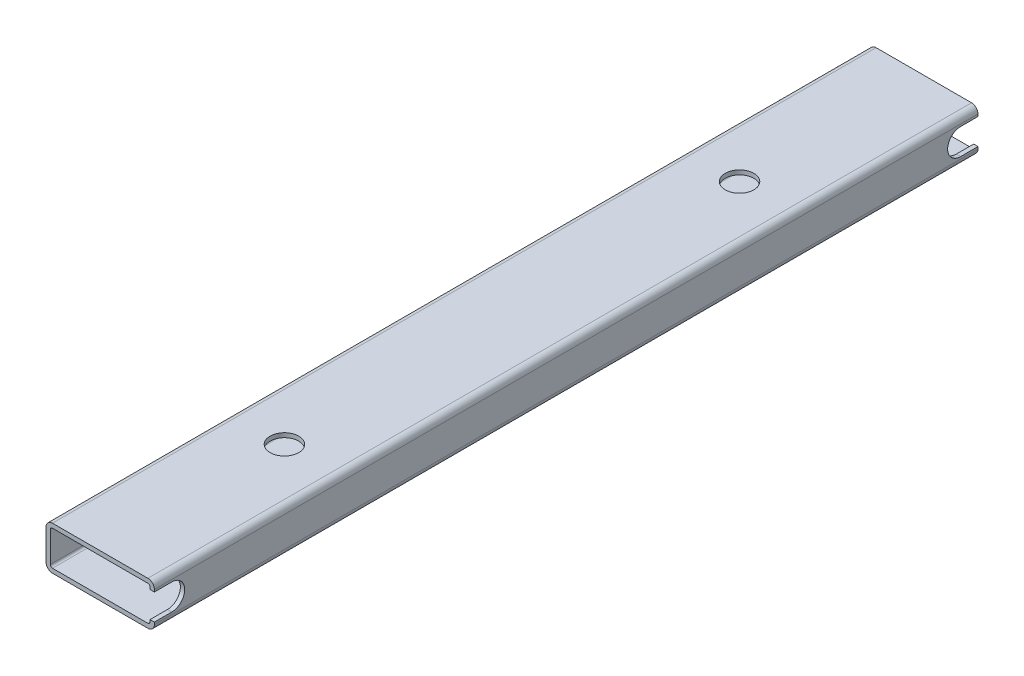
ISO-10303-21;
HEADER;
FILE_DESCRIPTION(('STEP AP214'),'2;1');
FILE_NAME('part.step','',(''),(''),'','','');
FILE_SCHEMA(('AUTOMOTIVE_DESIGN { 1 0 10303 214 1 1 1 1 }'));
ENDSEC;
DATA;
#1=APPLICATION_CONTEXT('core data for automotive mechanical design processes');
#2=APPLICATION_PROTOCOL_DEFINITION('international standard','automotive_design',2000,#1);
#3=PRODUCT_CONTEXT('',#1,'mechanical');
#4=PRODUCT('Part','Part','',(#3));
#5=PRODUCT_RELATED_PRODUCT_CATEGORY('part','',(#4));
#6=PRODUCT_DEFINITION_FORMATION('','',#4);
#7=PRODUCT_DEFINITION_CONTEXT('part definition',#1,'design');
#8=PRODUCT_DEFINITION('design','',#6,#7);
#9=PRODUCT_DEFINITION_SHAPE('','',#8);
#10=(LENGTH_UNIT() NAMED_UNIT(*) SI_UNIT(.MILLI.,.METRE.));
#11=(NAMED_UNIT(*) PLANE_ANGLE_UNIT() SI_UNIT($,.RADIAN.));
#12=(NAMED_UNIT(*) SI_UNIT($,.STERADIAN.) SOLID_ANGLE_UNIT());
#13=UNCERTAINTY_MEASURE_WITH_UNIT(LENGTH_MEASURE(1.E-05),#10,'distance_accuracy_value','');
#14=(GEOMETRIC_REPRESENTATION_CONTEXT(3) GLOBAL_UNCERTAINTY_ASSIGNED_CONTEXT((#13)) GLOBAL_UNIT_ASSIGNED_CONTEXT((#10,
#11,#12)) REPRESENTATION_CONTEXT('',''));
#15=CARTESIAN_POINT('',(0.,0.,0.));
#16=DIRECTION('',(0.,0.,1.));
#17=DIRECTION('',(1.,0.,0.));
#18=AXIS2_PLACEMENT_3D('',#15,#16,#17);
#19=CARTESIAN_POINT('',(-11.,-3.5,-95.));
#20=DIRECTION('',(0.,0.,1.));
#21=DIRECTION('',(1.,0.,0.));
#22=AXIS2_PLACEMENT_3D('',#19,#20,#21);
#23=PLANE('',#22);
#24=DIRECTION('',(1.,0.,0.));
#25=VECTOR('',#24,1.);
#26=CARTESIAN_POINT('',(-12.501,2.99999999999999,-95.));
#27=LINE('',#26,#25);
#28=CARTESIAN_POINT('',(11.5,3.00000000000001,-95.));
#29=VERTEX_POINT('',#28);
#30=CARTESIAN_POINT('',(12.5,3.00000000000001,-95.));
#31=VERTEX_POINT('',#30);
#32=EDGE_CURVE('E222',#29,#31,#27,.T.);
#33=ORIENTED_EDGE('',*,*,#32,.F.);
#34=DIRECTION('',(0.,1.,0.));
#35=VECTOR('',#34,1.);
#36=CARTESIAN_POINT('',(11.5,3.5,-95.));
#37=LINE('',#36,#35);
#38=CARTESIAN_POINT('',(11.5,3.5,-95.));
#39=VERTEX_POINT('',#38);
#40=EDGE_CURVE('E304',#29,#39,#37,.T.);
#41=ORIENTED_EDGE('',*,*,#40,.T.);
#42=CARTESIAN_POINT('',(11.,3.5,-95.));
#43=DIRECTION('',(0.,0.,1.));
#44=DIRECTION('',(-1.,0.,0.));
#45=AXIS2_PLACEMENT_3D('',#42,#43,#44);
#46=CIRCLE('',#45,0.5);
#47=CARTESIAN_POINT('',(11.,4.,-95.));
#48=VERTEX_POINT('',#47);
#49=EDGE_CURVE('E307',#39,#48,#46,.T.);
#50=ORIENTED_EDGE('',*,*,#49,.T.);
#51=DIRECTION('',(-1.,0.,0.));
#52=VECTOR('',#51,1.);
#53=CARTESIAN_POINT('',(-11.,4.,-95.));
#54=LINE('',#53,#52);
#55=CARTESIAN_POINT('',(-11.,4.,-95.));
#56=VERTEX_POINT('',#55);
#57=EDGE_CURVE('E272',#48,#56,#54,.T.);
#58=ORIENTED_EDGE('',*,*,#57,.T.);
#59=CARTESIAN_POINT('',(-11.,3.5,-95.));
#60=DIRECTION('',(0.,0.,1.));
#61=DIRECTION('',(1.,0.,0.));
#62=AXIS2_PLACEMENT_3D('',#59,#60,#61);
#63=CIRCLE('',#62,0.499999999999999);
#64=CARTESIAN_POINT('',(-11.5,3.5,-95.));
#65=VERTEX_POINT('',#64);
#66=EDGE_CURVE('E268',#56,#65,#63,.T.);
#67=ORIENTED_EDGE('',*,*,#66,.T.);
#68=DIRECTION('',(0.,-1.,0.));
#69=VECTOR('',#68,1.);
#70=CARTESIAN_POINT('',(-11.5,3.5,-95.));
#71=LINE('',#70,#69);
#72=CARTESIAN_POINT('',(-11.5,-3.5,-95.));
#73=VERTEX_POINT('',#72);
#74=EDGE_CURVE('E292',#65,#73,#71,.T.);
#75=ORIENTED_EDGE('',*,*,#74,.T.);
#76=CARTESIAN_POINT('',(-11.,-3.5,-95.));
#77=DIRECTION('',(0.,0.,1.));
#78=DIRECTION('',(1.,0.,0.));
#79=AXIS2_PLACEMENT_3D('',#76,#77,#78);
#80=CIRCLE('',#79,0.5);
#81=CARTESIAN_POINT('',(-11.,-4.,-95.));
#82=VERTEX_POINT('',#81);
#83=EDGE_CURVE('E295',#73,#82,#80,.T.);
#84=ORIENTED_EDGE('',*,*,#83,.T.);
#85=DIRECTION('',(1.,0.,0.));
#86=VECTOR('',#85,1.);
#87=CARTESIAN_POINT('',(-11.,-4.,-95.));
#88=LINE('',#87,#86);
#89=CARTESIAN_POINT('',(11.,-4.,-95.));
#90=VERTEX_POINT('',#89);
#91=EDGE_CURVE('E298',#82,#90,#88,.T.);
#92=ORIENTED_EDGE('',*,*,#91,.T.);
#93=CARTESIAN_POINT('',(11.,-3.5,-95.));
#94=DIRECTION('',(0.,0.,1.));
#95=DIRECTION('',(1.,0.,0.));
#96=AXIS2_PLACEMENT_3D('',#93,#94,#95);
#97=CIRCLE('',#96,0.499999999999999);
#98=CARTESIAN_POINT('',(11.5,-3.5,-95.));
#99=VERTEX_POINT('',#98);
#100=EDGE_CURVE('E301',#90,#99,#97,.T.);
#101=ORIENTED_EDGE('',*,*,#100,.T.);
#102=CARTESIAN_POINT('',(11.5,-3.,-95.));
#103=VERTEX_POINT('',#102);
#104=EDGE_CURVE('E305',#99,#103,#37,.T.);
#105=ORIENTED_EDGE('',*,*,#104,.T.);
#106=DIRECTION('',(1.,0.,0.));
#107=VECTOR('',#106,1.);
#108=CARTESIAN_POINT('',(-12.501,-3.00000000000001,-95.));
#109=LINE('',#108,#107);
#110=CARTESIAN_POINT('',(12.5,-2.99999999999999,-95.));
#111=VERTEX_POINT('',#110);
#112=EDGE_CURVE('E48',#103,#111,#109,.T.);
#113=ORIENTED_EDGE('',*,*,#112,.T.);
#114=DIRECTION('',(0.,1.,0.));
#115=VECTOR('',#114,1.);
#116=CARTESIAN_POINT('',(12.5,3.5,-95.));
#117=LINE('',#116,#115);
#118=CARTESIAN_POINT('',(12.5,-3.5,-95.));
#119=VERTEX_POINT('',#118);
#120=EDGE_CURVE('E359',#119,#111,#117,.T.);
#121=ORIENTED_EDGE('',*,*,#120,.F.);
#122=CARTESIAN_POINT('',(11.,-3.5,-95.));
#123=DIRECTION('',(0.,0.,1.));
#124=DIRECTION('',(1.,0.,0.));
#125=AXIS2_PLACEMENT_3D('',#122,#123,#124);
#126=CIRCLE('',#125,1.5);
#127=CARTESIAN_POINT('',(11.,-5.,-95.));
#128=VERTEX_POINT('',#127);
#129=EDGE_CURVE('E356',#128,#119,#126,.T.);
#130=ORIENTED_EDGE('',*,*,#129,.F.);
#131=DIRECTION('',(1.,0.,0.));
#132=VECTOR('',#131,1.);
#133=CARTESIAN_POINT('',(-11.,-5.,-95.));
#134=LINE('',#133,#132);
#135=CARTESIAN_POINT('',(-11.,-5.,-95.));
#136=VERTEX_POINT('',#135);
#137=EDGE_CURVE('E354',#136,#128,#134,.T.);
#138=ORIENTED_EDGE('',*,*,#137,.F.);
#139=CARTESIAN_POINT('',(-11.,-3.5,-95.));
#140=DIRECTION('',(0.,0.,1.));
#141=DIRECTION('',(1.,0.,0.));
#142=AXIS2_PLACEMENT_3D('',#139,#140,#141);
#143=CIRCLE('',#142,1.5);
#144=CARTESIAN_POINT('',(-12.5,-3.5,-95.));
#145=VERTEX_POINT('',#144);
#146=EDGE_CURVE('E330',#145,#136,#143,.T.);
#147=ORIENTED_EDGE('',*,*,#146,.F.);
#148=DIRECTION('',(0.,-1.,0.));
#149=VECTOR('',#148,1.);
#150=CARTESIAN_POINT('',(-12.5,3.5,-95.));
#151=LINE('',#150,#149);
#152=CARTESIAN_POINT('',(-12.5,3.5,-95.));
#153=VERTEX_POINT('',#152);
#154=EDGE_CURVE('E335',#153,#145,#151,.T.);
#155=ORIENTED_EDGE('',*,*,#154,.F.);
#156=CARTESIAN_POINT('',(-11.,3.5,-95.));
#157=DIRECTION('',(0.,0.,1.));
#158=DIRECTION('',(1.,0.,0.));
#159=AXIS2_PLACEMENT_3D('',#156,#157,#158);
#160=CIRCLE('',#159,1.5);
#161=CARTESIAN_POINT('',(-11.,5.,-95.));
#162=VERTEX_POINT('',#161);
#163=EDGE_CURVE('E366',#162,#153,#160,.T.);
#164=ORIENTED_EDGE('',*,*,#163,.F.);
#165=DIRECTION('',(-1.,0.,0.));
#166=VECTOR('',#165,1.);
#167=CARTESIAN_POINT('',(-11.,5.,-95.));
#168=LINE('',#167,#166);
#169=CARTESIAN_POINT('',(11.,5.,-95.));
#170=VERTEX_POINT('',#169);
#171=EDGE_CURVE('E364',#170,#162,#168,.T.);
#172=ORIENTED_EDGE('',*,*,#171,.F.);
#173=CARTESIAN_POINT('',(11.,3.5,-95.));
#174=DIRECTION('',(0.,0.,1.));
#175=DIRECTION('',(-1.,0.,0.));
#176=AXIS2_PLACEMENT_3D('',#173,#174,#175);
#177=CIRCLE('',#176,1.5);
#178=CARTESIAN_POINT('',(12.5,3.5,-95.));
#179=VERTEX_POINT('',#178);
#180=EDGE_CURVE('E362',#179,#170,#177,.T.);
#181=ORIENTED_EDGE('',*,*,#180,.F.);
#182=EDGE_CURVE('E358',#31,#179,#117,.T.);
#183=ORIENTED_EDGE('',*,*,#182,.F.);
#184=EDGE_LOOP('',(#33,#41,#50,#58,#67,#75,#84,#92,#101,#105,#113,#121,#130,#138,#147,#155,#164,
#172,#181,#183));
#185=FACE_BOUND('',#184,.T.);
#186=ADVANCED_FACE('F32',(#185),#23,.F.);
#187=CARTESIAN_POINT('',(12.5,3.5,95.));
#188=DIRECTION('',(-1.,0.,0.));
#189=DIRECTION('',(0.,-1.,0.));
#190=AXIS2_PLACEMENT_3D('',#187,#188,#189);
#191=PLANE('',#190);
#192=DIRECTION('',(0.,0.,-1.));
#193=VECTOR('',#192,1.);
#194=CARTESIAN_POINT('',(12.5,3.00000000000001,-95.));
#195=LINE('',#194,#193);
#196=CARTESIAN_POINT('',(12.5,3.00000000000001,-91.));
#197=VERTEX_POINT('',#196);
#198=EDGE_CURVE('E203',#197,#31,#195,.T.);
#199=ORIENTED_EDGE('',*,*,#198,.T.);
#200=ORIENTED_EDGE('',*,*,#182,.T.);
#201=DIRECTION('',(0.,0.,-1.));
#202=VECTOR('',#201,1.);
#203=CARTESIAN_POINT('',(12.5,3.5,95.));
#204=LINE('',#203,#202);
#205=CARTESIAN_POINT('',(12.5,3.5,95.));
#206=VERTEX_POINT('',#205);
#207=EDGE_CURVE('E380',#206,#179,#204,.T.);
#208=ORIENTED_EDGE('',*,*,#207,.F.);
#209=DIRECTION('',(0.,1.,0.));
#210=VECTOR('',#209,1.);
#211=CARTESIAN_POINT('',(12.5,3.5,95.));
#212=LINE('',#211,#210);
#213=CARTESIAN_POINT('',(12.5,3.00000000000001,95.));
#214=VERTEX_POINT('',#213);
#215=EDGE_CURVE('E339',#214,#206,#212,.T.);
#216=ORIENTED_EDGE('',*,*,#215,.F.);
#217=DIRECTION('',(0.,0.,1.));
#218=VECTOR('',#217,1.);
#219=CARTESIAN_POINT('',(12.5,3.00000000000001,95.));
#220=LINE('',#219,#218);
#221=CARTESIAN_POINT('',(12.5,3.00000000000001,91.));
#222=VERTEX_POINT('',#221);
#223=EDGE_CURVE('E235',#222,#214,#220,.T.);
#224=ORIENTED_EDGE('',*,*,#223,.F.);
#225=CARTESIAN_POINT('',(12.5,0.,91.));
#226=DIRECTION('',(1.,0.,0.));
#227=DIRECTION('',(0.,-1.,0.));
#228=AXIS2_PLACEMENT_3D('',#225,#226,#227);
#229=CIRCLE('',#228,3.);
#230=CARTESIAN_POINT('',(12.5,-2.99999999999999,91.));
#231=VERTEX_POINT('',#230);
#232=EDGE_CURVE('E232',#231,#222,#229,.T.);
#233=ORIENTED_EDGE('',*,*,#232,.F.);
#234=DIRECTION('',(0.,0.,-1.));
#235=VECTOR('',#234,1.);
#236=CARTESIAN_POINT('',(12.5,-2.99999999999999,91.));
#237=LINE('',#236,#235);
#238=CARTESIAN_POINT('',(12.5,-2.99999999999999,95.));
#239=VERTEX_POINT('',#238);
#240=EDGE_CURVE('E229',#239,#231,#237,.T.);
#241=ORIENTED_EDGE('',*,*,#240,.F.);
#242=CARTESIAN_POINT('',(12.5,-3.5,95.));
#243=VERTEX_POINT('',#242);
#244=EDGE_CURVE('E340',#243,#239,#212,.T.);
#245=ORIENTED_EDGE('',*,*,#244,.F.);
#246=DIRECTION('',(0.,0.,-1.));
#247=VECTOR('',#246,1.);
#248=CARTESIAN_POINT('',(12.5,-3.5,95.));
#249=LINE('',#248,#247);
#250=EDGE_CURVE('E383',#243,#119,#249,.T.);
#251=ORIENTED_EDGE('',*,*,#250,.T.);
#252=ORIENTED_EDGE('',*,*,#120,.T.);
#253=DIRECTION('',(0.,0.,1.));
#254=VECTOR('',#253,1.);
#255=CARTESIAN_POINT('',(12.5,-2.99999999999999,-91.));
#256=LINE('',#255,#254);
#257=CARTESIAN_POINT('',(12.5,-2.99999999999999,-91.));
#258=VERTEX_POINT('',#257);
#259=EDGE_CURVE('E219',#111,#258,#256,.T.);
#260=ORIENTED_EDGE('',*,*,#259,.T.);
#261=CARTESIAN_POINT('',(12.5,0.,-91.));
#262=DIRECTION('',(-1.,0.,0.));
#263=DIRECTION('',(0.,-1.,0.));
#264=AXIS2_PLACEMENT_3D('',#261,#262,#263);
#265=CIRCLE('',#264,3.);
#266=EDGE_CURVE('E201',#258,#197,#265,.T.);
#267=ORIENTED_EDGE('',*,*,#266,.T.);
#268=EDGE_LOOP('',(#199,#200,#208,#216,#224,#233,#241,#245,#251,#252,#260,#267));
#269=FACE_BOUND('',#268,.T.);
#270=ADVANCED_FACE('F400',(#269),#191,.F.);
#271=CARTESIAN_POINT('',(11.5,3.5,95.));
#272=DIRECTION('',(-1.,0.,0.));
#273=DIRECTION('',(0.,0.,1.));
#274=AXIS2_PLACEMENT_3D('',#271,#272,#273);
#275=PLANE('',#274);
#276=ORIENTED_EDGE('',*,*,#40,.F.);
#277=DIRECTION('',(0.,0.,-1.));
#278=VECTOR('',#277,1.);
#279=CARTESIAN_POINT('',(11.5,3.00000000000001,-95.));
#280=LINE('',#279,#278);
#281=CARTESIAN_POINT('',(11.5,3.00000000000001,-91.));
#282=VERTEX_POINT('',#281);
#283=EDGE_CURVE('E213',#282,#29,#280,.T.);
#284=ORIENTED_EDGE('',*,*,#283,.F.);
#285=CARTESIAN_POINT('',(11.5,0.,-91.));
#286=DIRECTION('',(-1.,0.,0.));
#287=DIRECTION('',(0.,0.,1.));
#288=AXIS2_PLACEMENT_3D('',#285,#286,#287);
#289=CIRCLE('',#288,3.);
#290=CARTESIAN_POINT('',(11.5,-2.99999999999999,-91.));
#291=VERTEX_POINT('',#290);
#292=EDGE_CURVE('E198',#291,#282,#289,.T.);
#293=ORIENTED_EDGE('',*,*,#292,.F.);
#294=DIRECTION('',(0.,0.,1.));
#295=VECTOR('',#294,1.);
#296=CARTESIAN_POINT('',(11.5,-2.99999999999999,-91.));
#297=LINE('',#296,#295);
#298=EDGE_CURVE('E205',#103,#291,#297,.T.);
#299=ORIENTED_EDGE('',*,*,#298,.F.);
#300=ORIENTED_EDGE('',*,*,#104,.F.);
#301=DIRECTION('',(0.,0.,-1.));
#302=VECTOR('',#301,1.);
#303=CARTESIAN_POINT('',(11.5,-3.5,95.));
#304=LINE('',#303,#302);
#305=CARTESIAN_POINT('',(11.5,-3.5,95.));
#306=VERTEX_POINT('',#305);
#307=EDGE_CURVE('E319',#306,#99,#304,.T.);
#308=ORIENTED_EDGE('',*,*,#307,.F.);
#309=DIRECTION('',(0.,1.,0.));
#310=VECTOR('',#309,1.);
#311=CARTESIAN_POINT('',(11.5,3.5,95.));
#312=LINE('',#311,#310);
#313=CARTESIAN_POINT('',(11.5,-3.,95.));
#314=VERTEX_POINT('',#313);
#315=EDGE_CURVE('E281',#306,#314,#312,.T.);
#316=ORIENTED_EDGE('',*,*,#315,.T.);
#317=DIRECTION('',(0.,0.,-1.));
#318=VECTOR('',#317,1.);
#319=CARTESIAN_POINT('',(11.5,-2.99999999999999,91.));
#320=LINE('',#319,#318);
#321=CARTESIAN_POINT('',(11.5,-2.99999999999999,91.));
#322=VERTEX_POINT('',#321);
#323=EDGE_CURVE('E239',#314,#322,#320,.T.);
#324=ORIENTED_EDGE('',*,*,#323,.T.);
#325=CARTESIAN_POINT('',(11.5,0.,91.));
#326=DIRECTION('',(-1.,0.,0.));
#327=DIRECTION('',(0.,0.,1.));
#328=AXIS2_PLACEMENT_3D('',#325,#326,#327);
#329=CIRCLE('',#328,3.);
#330=CARTESIAN_POINT('',(11.5,3.00000000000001,91.));
#331=VERTEX_POINT('',#330);
#332=EDGE_CURVE('E224',#322,#331,#329,.F.);
#333=ORIENTED_EDGE('',*,*,#332,.T.);
#334=DIRECTION('',(0.,0.,1.));
#335=VECTOR('',#334,1.);
#336=CARTESIAN_POINT('',(11.5,3.00000000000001,95.));
#337=LINE('',#336,#335);
#338=CARTESIAN_POINT('',(11.5,3.00000000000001,95.));
#339=VERTEX_POINT('',#338);
#340=EDGE_CURVE('E227',#331,#339,#337,.T.);
#341=ORIENTED_EDGE('',*,*,#340,.T.);
#342=CARTESIAN_POINT('',(11.5,3.5,95.));
#343=VERTEX_POINT('',#342);
#344=EDGE_CURVE('E280',#339,#343,#312,.T.);
#345=ORIENTED_EDGE('',*,*,#344,.T.);
#346=DIRECTION('',(0.,0.,-1.));
#347=VECTOR('',#346,1.);
#348=CARTESIAN_POINT('',(11.5,3.5,95.));
#349=LINE('',#348,#347);
#350=EDGE_CURVE('E316',#343,#39,#349,.T.);
#351=ORIENTED_EDGE('',*,*,#350,.T.);
#352=EDGE_LOOP('',(#276,#284,#293,#299,#300,#308,#316,#324,#333,#341,#345,#351));
#353=FACE_BOUND('',#352,.T.);
#354=ADVANCED_FACE('F212',(#353),#275,.T.);
#355=CARTESIAN_POINT('',(-11.,-3.5,95.));
#356=DIRECTION('',(0.,0.,1.));
#357=DIRECTION('',(1.,0.,0.));
#358=AXIS2_PLACEMENT_3D('',#355,#356,#357);
#359=PLANE('',#358);
#360=DIRECTION('',(1.,0.,0.));
#361=VECTOR('',#360,1.);
#362=CARTESIAN_POINT('',(-12.501,-3.00000000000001,95.));
#363=LINE('',#362,#361);
#364=EDGE_CURVE('E237',#314,#239,#363,.T.);
#365=ORIENTED_EDGE('',*,*,#364,.F.);
#366=ORIENTED_EDGE('',*,*,#315,.F.);
#367=CARTESIAN_POINT('',(11.,-3.5,95.));
#368=DIRECTION('',(0.,0.,1.));
#369=DIRECTION('',(1.,0.,0.));
#370=AXIS2_PLACEMENT_3D('',#367,#368,#369);
#371=CIRCLE('',#370,0.499999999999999);
#372=CARTESIAN_POINT('',(11.,-4.,95.));
#373=VERTEX_POINT('',#372);
#374=EDGE_CURVE('E278',#373,#306,#371,.T.);
#375=ORIENTED_EDGE('',*,*,#374,.F.);
#376=DIRECTION('',(1.,0.,0.));
#377=VECTOR('',#376,1.);
#378=CARTESIAN_POINT('',(-11.,-4.,95.));
#379=LINE('',#378,#377);
#380=CARTESIAN_POINT('',(-11.,-4.,95.));
#381=VERTEX_POINT('',#380);
#382=EDGE_CURVE('E276',#381,#373,#379,.T.);
#383=ORIENTED_EDGE('',*,*,#382,.F.);
#384=CARTESIAN_POINT('',(-11.,-3.5,95.));
#385=DIRECTION('',(0.,0.,1.));
#386=DIRECTION('',(1.,0.,0.));
#387=AXIS2_PLACEMENT_3D('',#384,#385,#386);
#388=CIRCLE('',#387,0.5);
#389=CARTESIAN_POINT('',(-11.5,-3.5,95.));
#390=VERTEX_POINT('',#389);
#391=EDGE_CURVE('E274',#390,#381,#388,.T.);
#392=ORIENTED_EDGE('',*,*,#391,.F.);
#393=DIRECTION('',(0.,-1.,0.));
#394=VECTOR('',#393,1.);
#395=CARTESIAN_POINT('',(-11.5,3.5,95.));
#396=LINE('',#395,#394);
#397=CARTESIAN_POINT('',(-11.5,3.5,95.));
#398=VERTEX_POINT('',#397);
#399=EDGE_CURVE('E271',#398,#390,#396,.T.);
#400=ORIENTED_EDGE('',*,*,#399,.F.);
#401=CARTESIAN_POINT('',(-11.,3.5,95.));
#402=DIRECTION('',(0.,0.,1.));
#403=DIRECTION('',(1.,0.,0.));
#404=AXIS2_PLACEMENT_3D('',#401,#402,#403);
#405=CIRCLE('',#404,0.499999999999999);
#406=CARTESIAN_POINT('',(-11.,4.,95.));
#407=VERTEX_POINT('',#406);
#408=EDGE_CURVE('E269',#407,#398,#405,.T.);
#409=ORIENTED_EDGE('',*,*,#408,.F.);
#410=DIRECTION('',(-1.,0.,0.));
#411=VECTOR('',#410,1.);
#412=CARTESIAN_POINT('',(-11.,4.,95.));
#413=LINE('',#412,#411);
#414=CARTESIAN_POINT('',(11.,4.,95.));
#415=VERTEX_POINT('',#414);
#416=EDGE_CURVE('E287',#415,#407,#413,.T.);
#417=ORIENTED_EDGE('',*,*,#416,.F.);
#418=CARTESIAN_POINT('',(11.,3.5,95.));
#419=DIRECTION('',(0.,0.,1.));
#420=DIRECTION('',(-1.,0.,0.));
#421=AXIS2_PLACEMENT_3D('',#418,#419,#420);
#422=CIRCLE('',#421,0.5);
#423=EDGE_CURVE('E284',#343,#415,#422,.T.);
#424=ORIENTED_EDGE('',*,*,#423,.F.);
#425=ORIENTED_EDGE('',*,*,#344,.F.);
#426=DIRECTION('',(1.,0.,0.));
#427=VECTOR('',#426,1.);
#428=CARTESIAN_POINT('',(-12.501,2.99999999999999,95.));
#429=LINE('',#428,#427);
#430=EDGE_CURVE('E56',#339,#214,#429,.T.);
#431=ORIENTED_EDGE('',*,*,#430,.T.);
#432=ORIENTED_EDGE('',*,*,#215,.T.);
#433=CARTESIAN_POINT('',(11.,3.5,95.));
#434=DIRECTION('',(0.,0.,1.));
#435=DIRECTION('',(-1.,0.,0.));
#436=AXIS2_PLACEMENT_3D('',#433,#434,#435);
#437=CIRCLE('',#436,1.5);
#438=CARTESIAN_POINT('',(11.,5.,95.));
#439=VERTEX_POINT('',#438);
#440=EDGE_CURVE('E343',#206,#439,#437,.T.);
#441=ORIENTED_EDGE('',*,*,#440,.T.);
#442=DIRECTION('',(-1.,0.,0.));
#443=VECTOR('',#442,1.);
#444=CARTESIAN_POINT('',(-11.,5.,95.));
#445=LINE('',#444,#443);
#446=CARTESIAN_POINT('',(-11.,5.,95.));
#447=VERTEX_POINT('',#446);
#448=EDGE_CURVE('E345',#439,#447,#445,.T.);
#449=ORIENTED_EDGE('',*,*,#448,.T.);
#450=CARTESIAN_POINT('',(-11.,3.5,95.));
#451=DIRECTION('',(0.,0.,1.));
#452=DIRECTION('',(1.,0.,0.));
#453=AXIS2_PLACEMENT_3D('',#450,#451,#452);
#454=CIRCLE('',#453,1.5);
#455=CARTESIAN_POINT('',(-12.5,3.5,95.));
#456=VERTEX_POINT('',#455);
#457=EDGE_CURVE('E347',#447,#456,#454,.T.);
#458=ORIENTED_EDGE('',*,*,#457,.T.);
#459=DIRECTION('',(0.,-1.,0.));
#460=VECTOR('',#459,1.);
#461=CARTESIAN_POINT('',(-12.5,3.5,95.));
#462=LINE('',#461,#460);
#463=CARTESIAN_POINT('',(-12.5,-3.5,95.));
#464=VERTEX_POINT('',#463);
#465=EDGE_CURVE('E349',#456,#464,#462,.T.);
#466=ORIENTED_EDGE('',*,*,#465,.T.);
#467=CARTESIAN_POINT('',(-11.,-3.5,95.));
#468=DIRECTION('',(0.,0.,1.));
#469=DIRECTION('',(1.,0.,0.));
#470=AXIS2_PLACEMENT_3D('',#467,#468,#469);
#471=CIRCLE('',#470,1.5);
#472=CARTESIAN_POINT('',(-11.,-5.,95.));
#473=VERTEX_POINT('',#472);
#474=EDGE_CURVE('E331',#464,#473,#471,.T.);
#475=ORIENTED_EDGE('',*,*,#474,.T.);
#476=DIRECTION('',(1.,0.,0.));
#477=VECTOR('',#476,1.);
#478=CARTESIAN_POINT('',(-11.,-5.,95.));
#479=LINE('',#478,#477);
#480=CARTESIAN_POINT('',(11.,-5.,95.));
#481=VERTEX_POINT('',#480);
#482=EDGE_CURVE('E334',#473,#481,#479,.T.);
#483=ORIENTED_EDGE('',*,*,#482,.T.);
#484=CARTESIAN_POINT('',(11.,-3.5,95.));
#485=DIRECTION('',(0.,0.,1.));
#486=DIRECTION('',(1.,0.,0.));
#487=AXIS2_PLACEMENT_3D('',#484,#485,#486);
#488=CIRCLE('',#487,1.5);
#489=EDGE_CURVE('E337',#481,#243,#488,.T.);
#490=ORIENTED_EDGE('',*,*,#489,.T.);
#491=ORIENTED_EDGE('',*,*,#244,.T.);
#492=EDGE_LOOP('',(#365,#366,#375,#383,#392,#400,#409,#417,#424,#425,#431,#432,#441,#449,#458,
#466,#475,#483,#490,#491));
#493=FACE_BOUND('',#492,.T.);
#494=ADVANCED_FACE('F406',(#493),#359,.T.);
#495=CARTESIAN_POINT('',(-11.,-3.5,95.));
#496=DIRECTION('',(0.,0.,-1.));
#497=DIRECTION('',(-1.,0.,0.));
#498=AXIS2_PLACEMENT_3D('',#495,#496,#497);
#499=CYLINDRICAL_SURFACE('',#498,1.5);
#500=ORIENTED_EDGE('',*,*,#146,.T.);
#501=DIRECTION('',(0.,0.,-1.));
#502=VECTOR('',#501,1.);
#503=CARTESIAN_POINT('',(-11.,-5.,95.));
#504=LINE('',#503,#502);
#505=EDGE_CURVE('E11',#473,#136,#504,.T.);
#506=ORIENTED_EDGE('',*,*,#505,.F.);
#507=ORIENTED_EDGE('',*,*,#474,.F.);
#508=DIRECTION('',(0.,0.,-1.));
#509=VECTOR('',#508,1.);
#510=CARTESIAN_POINT('',(-12.5,-3.5,95.));
#511=LINE('',#510,#509);
#512=EDGE_CURVE('E351',#464,#145,#511,.T.);
#513=ORIENTED_EDGE('',*,*,#512,.T.);
#514=EDGE_LOOP('',(#500,#506,#507,#513));
#515=FACE_BOUND('',#514,.T.);
#516=ADVANCED_FACE('F34',(#515),#499,.T.);
#517=CARTESIAN_POINT('',(-11.,-5.,95.));
#518=DIRECTION('',(0.,1.,0.));
#519=DIRECTION('',(-1.,0.,0.));
#520=AXIS2_PLACEMENT_3D('',#517,#518,#519);
#521=PLANE('',#520);
#522=CARTESIAN_POINT('',(0.,-4.99999999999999,52.5));
#523=DIRECTION('',(0.,1.,0.));
#524=DIRECTION('',(0.,0.,1.));
#525=AXIS2_PLACEMENT_3D('',#522,#523,#524);
#526=CIRCLE('',#525,3.29999999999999);
#527=CARTESIAN_POINT('',(0.,-4.99999999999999,55.8));
#528=VERTEX_POINT('',#527);
#529=EDGE_CURVE('E250',#528,#528,#526,.T.);
#530=ORIENTED_EDGE('',*,*,#529,.T.);
#531=EDGE_LOOP('',(#530));
#532=FACE_BOUND('',#531,.T.);
#533=CARTESIAN_POINT('',(0.,-4.99999999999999,-52.5));
#534=DIRECTION('',(0.,1.,0.));
#535=DIRECTION('',(0.,0.,1.));
#536=AXIS2_PLACEMENT_3D('',#533,#534,#535);
#537=CIRCLE('',#536,3.29999999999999);
#538=CARTESIAN_POINT('',(0.,-4.99999999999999,-49.2));
#539=VERTEX_POINT('',#538);
#540=EDGE_CURVE('E259',#539,#539,#537,.T.);
#541=ORIENTED_EDGE('',*,*,#540,.T.);
#542=EDGE_LOOP('',(#541));
#543=FACE_BOUND('',#542,.T.);
#544=ORIENTED_EDGE('',*,*,#137,.T.);
#545=DIRECTION('',(0.,0.,-1.));
#546=VECTOR('',#545,1.);
#547=CARTESIAN_POINT('',(11.,-5.,95.));
#548=LINE('',#547,#546);
#549=EDGE_CURVE('E41',#481,#128,#548,.T.);
#550=ORIENTED_EDGE('',*,*,#549,.F.);
#551=ORIENTED_EDGE('',*,*,#482,.F.);
#552=ORIENTED_EDGE('',*,*,#505,.T.);
#553=EDGE_LOOP('',(#544,#550,#551,#552));
#554=FACE_BOUND('',#553,.T.);
#555=ADVANCED_FACE('F410',(#532,#543,#554),#521,.F.);
#556=CARTESIAN_POINT('',(11.,-3.5,95.));
#557=DIRECTION('',(0.,0.,-1.));
#558=DIRECTION('',(-1.,0.,0.));
#559=AXIS2_PLACEMENT_3D('',#556,#557,#558);
#560=CYLINDRICAL_SURFACE('',#559,1.5);
#561=ORIENTED_EDGE('',*,*,#129,.T.);
#562=ORIENTED_EDGE('',*,*,#250,.F.);
#563=ORIENTED_EDGE('',*,*,#489,.F.);
#564=ORIENTED_EDGE('',*,*,#549,.T.);
#565=EDGE_LOOP('',(#561,#562,#563,#564));
#566=FACE_BOUND('',#565,.T.);
#567=ADVANCED_FACE('F391',(#566),#560,.T.);
#568=CARTESIAN_POINT('',(11.,3.5,95.));
#569=DIRECTION('',(0.,0.,-1.));
#570=DIRECTION('',(-1.,0.,0.));
#571=AXIS2_PLACEMENT_3D('',#568,#569,#570);
#572=CYLINDRICAL_SURFACE('',#571,1.5);
#573=ORIENTED_EDGE('',*,*,#180,.T.);
#574=DIRECTION('',(0.,0.,-1.));
#575=VECTOR('',#574,1.);
#576=CARTESIAN_POINT('',(11.,5.,95.));
#577=LINE('',#576,#575);
#578=EDGE_CURVE('E377',#439,#170,#577,.T.);
#579=ORIENTED_EDGE('',*,*,#578,.F.);
#580=ORIENTED_EDGE('',*,*,#440,.F.);
#581=ORIENTED_EDGE('',*,*,#207,.T.);
#582=EDGE_LOOP('',(#573,#579,#580,#581));
#583=FACE_BOUND('',#582,.T.);
#584=ADVANCED_FACE('F431',(#583),#572,.T.);
#585=CARTESIAN_POINT('',(-11.,5.,95.));
#586=DIRECTION('',(0.,-1.,0.));
#587=DIRECTION('',(0.,0.,-1.));
#588=AXIS2_PLACEMENT_3D('',#585,#586,#587);
#589=PLANE('',#588);
#590=CARTESIAN_POINT('',(0.,5.,52.5));
#591=DIRECTION('',(0.,1.,0.));
#592=DIRECTION('',(0.,0.,1.));
#593=AXIS2_PLACEMENT_3D('',#590,#591,#592);
#594=CIRCLE('',#593,3.29999999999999);
#595=CARTESIAN_POINT('',(0.,5.,55.8));
#596=VERTEX_POINT('',#595);
#597=EDGE_CURVE('E247',#596,#596,#594,.T.);
#598=ORIENTED_EDGE('',*,*,#597,.F.);
#599=EDGE_LOOP('',(#598));
#600=FACE_BOUND('',#599,.T.);
#601=CARTESIAN_POINT('',(0.,5.,-52.5));
#602=DIRECTION('',(0.,1.,0.));
#603=DIRECTION('',(0.,0.,1.));
#604=AXIS2_PLACEMENT_3D('',#601,#602,#603);
#605=CIRCLE('',#604,3.29999999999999);
#606=CARTESIAN_POINT('',(0.,5.,-49.2));
#607=VERTEX_POINT('',#606);
#608=EDGE_CURVE('E256',#607,#607,#605,.T.);
#609=ORIENTED_EDGE('',*,*,#608,.F.);
#610=EDGE_LOOP('',(#609));
#611=FACE_BOUND('',#610,.T.);
#612=ORIENTED_EDGE('',*,*,#171,.T.);
#613=DIRECTION('',(0.,0.,-1.));
#614=VECTOR('',#613,1.);
#615=CARTESIAN_POINT('',(-11.,5.,95.));
#616=LINE('',#615,#614);
#617=EDGE_CURVE('E374',#447,#162,#616,.T.);
#618=ORIENTED_EDGE('',*,*,#617,.F.);
#619=ORIENTED_EDGE('',*,*,#448,.F.);
#620=ORIENTED_EDGE('',*,*,#578,.T.);
#621=EDGE_LOOP('',(#612,#618,#619,#620));
#622=FACE_BOUND('',#621,.T.);
#623=ADVANCED_FACE('F426',(#600,#611,#622),#589,.F.);
#624=CARTESIAN_POINT('',(-11.,3.5,95.));
#625=DIRECTION('',(0.,0.,-1.));
#626=DIRECTION('',(-1.,0.,0.));
#627=AXIS2_PLACEMENT_3D('',#624,#625,#626);
#628=CYLINDRICAL_SURFACE('',#627,1.5);
#629=ORIENTED_EDGE('',*,*,#163,.T.);
#630=DIRECTION('',(0.,0.,-1.));
#631=VECTOR('',#630,1.);
#632=CARTESIAN_POINT('',(-12.5,3.5,95.));
#633=LINE('',#632,#631);
#634=EDGE_CURVE('E371',#456,#153,#633,.T.);
#635=ORIENTED_EDGE('',*,*,#634,.F.);
#636=ORIENTED_EDGE('',*,*,#457,.F.);
#637=ORIENTED_EDGE('',*,*,#617,.T.);
#638=EDGE_LOOP('',(#629,#635,#636,#637));
#639=FACE_BOUND('',#638,.T.);
#640=ADVANCED_FACE('F422',(#639),#628,.T.);
#641=CARTESIAN_POINT('',(-12.5,3.5,95.));
#642=DIRECTION('',(1.,0.,0.));
#643=DIRECTION('',(0.,1.,0.));
#644=AXIS2_PLACEMENT_3D('',#641,#642,#643);
#645=PLANE('',#644);
#646=ORIENTED_EDGE('',*,*,#154,.T.);
#647=ORIENTED_EDGE('',*,*,#512,.F.);
#648=ORIENTED_EDGE('',*,*,#465,.F.);
#649=ORIENTED_EDGE('',*,*,#634,.T.);
#650=EDGE_LOOP('',(#646,#647,#648,#649));
#651=FACE_BOUND('',#650,.T.);
#652=ADVANCED_FACE('F417',(#651),#645,.F.);
#653=CARTESIAN_POINT('',(-11.,3.5,95.));
#654=DIRECTION('',(0.,0.,-1.));
#655=DIRECTION('',(-1.,0.,0.));
#656=AXIS2_PLACEMENT_3D('',#653,#654,#655);
#657=CYLINDRICAL_SURFACE('',#656,0.499999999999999);
#658=ORIENTED_EDGE('',*,*,#66,.F.);
#659=DIRECTION('',(0.,0.,-1.));
#660=VECTOR('',#659,1.);
#661=CARTESIAN_POINT('',(-11.,4.,95.));
#662=LINE('',#661,#660);
#663=EDGE_CURVE('E289',#407,#56,#662,.T.);
#664=ORIENTED_EDGE('',*,*,#663,.F.);
#665=ORIENTED_EDGE('',*,*,#408,.T.);
#666=DIRECTION('',(0.,0.,-1.));
#667=VECTOR('',#666,1.);
#668=CARTESIAN_POINT('',(-11.5,3.5,95.));
#669=LINE('',#668,#667);
#670=EDGE_CURVE('E327',#398,#65,#669,.T.);
#671=ORIENTED_EDGE('',*,*,#670,.T.);
#672=EDGE_LOOP('',(#658,#664,#665,#671));
#673=FACE_BOUND('',#672,.T.);
#674=ADVANCED_FACE('F454',(#673),#657,.F.);
#675=CARTESIAN_POINT('',(-11.5,3.5,95.));
#676=DIRECTION('',(1.,0.,0.));
#677=DIRECTION('',(0.,1.,0.));
#678=AXIS2_PLACEMENT_3D('',#675,#676,#677);
#679=PLANE('',#678);
#680=ORIENTED_EDGE('',*,*,#74,.F.);
#681=ORIENTED_EDGE('',*,*,#670,.F.);
#682=ORIENTED_EDGE('',*,*,#399,.T.);
#683=DIRECTION('',(0.,0.,-1.));
#684=VECTOR('',#683,1.);
#685=CARTESIAN_POINT('',(-11.5,-3.5,95.));
#686=LINE('',#685,#684);
#687=EDGE_CURVE('E325',#390,#73,#686,.T.);
#688=ORIENTED_EDGE('',*,*,#687,.T.);
#689=EDGE_LOOP('',(#680,#681,#682,#688));
#690=FACE_BOUND('',#689,.T.);
#691=ADVANCED_FACE('F461',(#690),#679,.T.);
#692=CARTESIAN_POINT('',(-11.,-3.5,95.));
#693=DIRECTION('',(0.,0.,-1.));
#694=DIRECTION('',(-1.,0.,0.));
#695=AXIS2_PLACEMENT_3D('',#692,#693,#694);
#696=CYLINDRICAL_SURFACE('',#695,0.5);
#697=ORIENTED_EDGE('',*,*,#83,.F.);
#698=ORIENTED_EDGE('',*,*,#687,.F.);
#699=ORIENTED_EDGE('',*,*,#391,.T.);
#700=DIRECTION('',(0.,0.,-1.));
#701=VECTOR('',#700,1.);
#702=CARTESIAN_POINT('',(-11.,-4.,95.));
#703=LINE('',#702,#701);
#704=EDGE_CURVE('E323',#381,#82,#703,.T.);
#705=ORIENTED_EDGE('',*,*,#704,.T.);
#706=EDGE_LOOP('',(#697,#698,#699,#705));
#707=FACE_BOUND('',#706,.T.);
#708=ADVANCED_FACE('F464',(#707),#696,.F.);
#709=CARTESIAN_POINT('',(-11.,-4.,95.));
#710=DIRECTION('',(0.,1.,0.));
#711=DIRECTION('',(0.,0.,1.));
#712=AXIS2_PLACEMENT_3D('',#709,#710,#711);
#713=PLANE('',#712);
#714=CARTESIAN_POINT('',(0.,-4.,52.5));
#715=DIRECTION('',(0.,1.,0.));
#716=DIRECTION('',(0.,0.,1.));
#717=AXIS2_PLACEMENT_3D('',#714,#715,#716);
#718=CIRCLE('',#717,3.29999999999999);
#719=CARTESIAN_POINT('',(0.,-4.,55.8));
#720=VERTEX_POINT('',#719);
#721=EDGE_CURVE('E253',#720,#720,#718,.T.);
#722=ORIENTED_EDGE('',*,*,#721,.F.);
#723=EDGE_LOOP('',(#722));
#724=FACE_BOUND('',#723,.T.);
#725=CARTESIAN_POINT('',(0.,-4.,-52.5));
#726=DIRECTION('',(0.,1.,0.));
#727=DIRECTION('',(0.,0.,1.));
#728=AXIS2_PLACEMENT_3D('',#725,#726,#727);
#729=CIRCLE('',#728,3.29999999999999);
#730=CARTESIAN_POINT('',(0.,-4.,-49.2));
#731=VERTEX_POINT('',#730);
#732=EDGE_CURVE('E262',#731,#731,#729,.T.);
#733=ORIENTED_EDGE('',*,*,#732,.F.);
#734=EDGE_LOOP('',(#733));
#735=FACE_BOUND('',#734,.T.);
#736=ORIENTED_EDGE('',*,*,#91,.F.);
#737=ORIENTED_EDGE('',*,*,#704,.F.);
#738=ORIENTED_EDGE('',*,*,#382,.T.);
#739=DIRECTION('',(0.,0.,-1.));
#740=VECTOR('',#739,1.);
#741=CARTESIAN_POINT('',(11.,-4.,95.));
#742=LINE('',#741,#740);
#743=EDGE_CURVE('E321',#373,#90,#742,.T.);
#744=ORIENTED_EDGE('',*,*,#743,.T.);
#745=EDGE_LOOP('',(#736,#737,#738,#744));
#746=FACE_BOUND('',#745,.T.);
#747=ADVANCED_FACE('F469',(#724,#735,#746),#713,.T.);
#748=CARTESIAN_POINT('',(11.,-3.5,95.));
#749=DIRECTION('',(0.,0.,-1.));
#750=DIRECTION('',(-1.,0.,0.));
#751=AXIS2_PLACEMENT_3D('',#748,#749,#750);
#752=CYLINDRICAL_SURFACE('',#751,0.499999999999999);
#753=ORIENTED_EDGE('',*,*,#100,.F.);
#754=ORIENTED_EDGE('',*,*,#743,.F.);
#755=ORIENTED_EDGE('',*,*,#374,.T.);
#756=ORIENTED_EDGE('',*,*,#307,.T.);
#757=EDGE_LOOP('',(#753,#754,#755,#756));
#758=FACE_BOUND('',#757,.T.);
#759=ADVANCED_FACE('F473',(#758),#752,.F.);
#760=CARTESIAN_POINT('',(11.,3.5,95.));
#761=DIRECTION('',(0.,0.,-1.));
#762=DIRECTION('',(-1.,0.,0.));
#763=AXIS2_PLACEMENT_3D('',#760,#761,#762);
#764=CYLINDRICAL_SURFACE('',#763,0.5);
#765=ORIENTED_EDGE('',*,*,#49,.F.);
#766=ORIENTED_EDGE('',*,*,#350,.F.);
#767=ORIENTED_EDGE('',*,*,#423,.T.);
#768=DIRECTION('',(0.,0.,-1.));
#769=VECTOR('',#768,1.);
#770=CARTESIAN_POINT('',(11.,4.,95.));
#771=LINE('',#770,#769);
#772=EDGE_CURVE('E314',#415,#48,#771,.T.);
#773=ORIENTED_EDGE('',*,*,#772,.T.);
#774=EDGE_LOOP('',(#765,#766,#767,#773));
#775=FACE_BOUND('',#774,.T.);
#776=ADVANCED_FACE('F446',(#775),#764,.F.);
#777=CARTESIAN_POINT('',(-11.,4.,95.));
#778=DIRECTION('',(0.,-1.,0.));
#779=DIRECTION('',(0.,0.,-1.));
#780=AXIS2_PLACEMENT_3D('',#777,#778,#779);
#781=PLANE('',#780);
#782=CARTESIAN_POINT('',(0.,4.,52.5));
#783=DIRECTION('',(0.,-1.,0.));
#784=DIRECTION('',(0.,0.,-1.));
#785=AXIS2_PLACEMENT_3D('',#782,#783,#784);
#786=CIRCLE('',#785,3.29999999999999);
#787=CARTESIAN_POINT('',(0.,4.,49.2));
#788=VERTEX_POINT('',#787);
#789=EDGE_CURVE('E36',#788,#788,#786,.T.);
#790=ORIENTED_EDGE('',*,*,#789,.F.);
#791=EDGE_LOOP('',(#790));
#792=FACE_BOUND('',#791,.T.);
#793=CARTESIAN_POINT('',(0.,4.,-52.5));
#794=DIRECTION('',(0.,-1.,0.));
#795=DIRECTION('',(0.,0.,-1.));
#796=AXIS2_PLACEMENT_3D('',#793,#794,#795);
#797=CIRCLE('',#796,3.29999999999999);
#798=CARTESIAN_POINT('',(0.,4.,-55.8));
#799=VERTEX_POINT('',#798);
#800=EDGE_CURVE('E265',#799,#799,#797,.T.);
#801=ORIENTED_EDGE('',*,*,#800,.F.);
#802=EDGE_LOOP('',(#801));
#803=FACE_BOUND('',#802,.T.);
#804=ORIENTED_EDGE('',*,*,#57,.F.);
#805=ORIENTED_EDGE('',*,*,#772,.F.);
#806=ORIENTED_EDGE('',*,*,#416,.T.);
#807=ORIENTED_EDGE('',*,*,#663,.T.);
#808=EDGE_LOOP('',(#804,#805,#806,#807));
#809=FACE_BOUND('',#808,.T.);
#810=ADVANCED_FACE('F449',(#792,#803,#809),#781,.T.);
#811=CARTESIAN_POINT('',(0.,5.,-52.5));
#812=DIRECTION('',(0.,1.,0.));
#813=DIRECTION('',(0.,0.,1.));
#814=AXIS2_PLACEMENT_3D('',#811,#812,#813);
#815=CYLINDRICAL_SURFACE('',#814,3.29999999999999);
#816=ORIENTED_EDGE('',*,*,#732,.T.);
#817=EDGE_LOOP('',(#816));
#818=FACE_BOUND('',#817,.T.);
#819=ORIENTED_EDGE('',*,*,#540,.F.);
#820=EDGE_LOOP('',(#819));
#821=FACE_BOUND('',#820,.T.);
#822=ADVANCED_FACE('F518',(#818,#821),#815,.F.);
#823=ORIENTED_EDGE('',*,*,#800,.T.);
#824=EDGE_LOOP('',(#823));
#825=FACE_BOUND('',#824,.T.);
#826=ORIENTED_EDGE('',*,*,#608,.T.);
#827=EDGE_LOOP('',(#826));
#828=FACE_BOUND('',#827,.T.);
#829=ADVANCED_FACE('F520',(#825,#828),#815,.F.);
#830=CARTESIAN_POINT('',(0.,5.,52.5));
#831=DIRECTION('',(0.,1.,0.));
#832=DIRECTION('',(0.,0.,1.));
#833=AXIS2_PLACEMENT_3D('',#830,#831,#832);
#834=CYLINDRICAL_SURFACE('',#833,3.29999999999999);
#835=ORIENTED_EDGE('',*,*,#789,.T.);
#836=EDGE_LOOP('',(#835));
#837=FACE_BOUND('',#836,.T.);
#838=ORIENTED_EDGE('',*,*,#597,.T.);
#839=EDGE_LOOP('',(#838));
#840=FACE_BOUND('',#839,.T.);
#841=ADVANCED_FACE('F527',(#837,#840),#834,.F.);
#842=ORIENTED_EDGE('',*,*,#721,.T.);
#843=EDGE_LOOP('',(#842));
#844=FACE_BOUND('',#843,.T.);
#845=ORIENTED_EDGE('',*,*,#529,.F.);
#846=EDGE_LOOP('',(#845));
#847=FACE_BOUND('',#846,.T.);
#848=ADVANCED_FACE('F595',(#844,#847),#834,.F.);
#849=CARTESIAN_POINT('',(-12.501,-3.00000000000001,91.));
#850=DIRECTION('',(0.,-1.,0.));
#851=DIRECTION('',(1.,0.,0.));
#852=AXIS2_PLACEMENT_3D('',#849,#850,#851);
#853=PLANE('',#852);
#854=ORIENTED_EDGE('',*,*,#364,.T.);
#855=ORIENTED_EDGE('',*,*,#240,.T.);
#856=DIRECTION('',(1.,0.,0.));
#857=VECTOR('',#856,1.);
#858=CARTESIAN_POINT('',(-12.501,-3.00000000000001,91.));
#859=LINE('',#858,#857);
#860=EDGE_CURVE('E242',#322,#231,#859,.T.);
#861=ORIENTED_EDGE('',*,*,#860,.F.);
#862=ORIENTED_EDGE('',*,*,#323,.F.);
#863=EDGE_LOOP('',(#854,#855,#861,#862));
#864=FACE_BOUND('',#863,.T.);
#865=ADVANCED_FACE('F477',(#864),#853,.F.);
#866=CARTESIAN_POINT('',(-12.501,0.,91.));
#867=DIRECTION('',(1.,0.,0.));
#868=DIRECTION('',(0.,1.,0.));
#869=AXIS2_PLACEMENT_3D('',#866,#867,#868);
#870=CYLINDRICAL_SURFACE('',#869,3.);
#871=ORIENTED_EDGE('',*,*,#860,.T.);
#872=ORIENTED_EDGE('',*,*,#232,.T.);
#873=DIRECTION('',(1.,0.,0.));
#874=VECTOR('',#873,1.);
#875=CARTESIAN_POINT('',(-12.501,2.99999999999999,91.));
#876=LINE('',#875,#874);
#877=EDGE_CURVE('E240',#331,#222,#876,.T.);
#878=ORIENTED_EDGE('',*,*,#877,.F.);
#879=ORIENTED_EDGE('',*,*,#332,.F.);
#880=EDGE_LOOP('',(#871,#872,#878,#879));
#881=FACE_BOUND('',#880,.T.);
#882=ADVANCED_FACE('F479',(#881),#870,.F.);
#883=CARTESIAN_POINT('',(-12.501,2.99999999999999,95.));
#884=DIRECTION('',(0.,1.,0.));
#885=DIRECTION('',(-1.,0.,0.));
#886=AXIS2_PLACEMENT_3D('',#883,#884,#885);
#887=PLANE('',#886);
#888=ORIENTED_EDGE('',*,*,#877,.T.);
#889=ORIENTED_EDGE('',*,*,#223,.T.);
#890=ORIENTED_EDGE('',*,*,#430,.F.);
#891=ORIENTED_EDGE('',*,*,#340,.F.);
#892=EDGE_LOOP('',(#888,#889,#890,#891));
#893=FACE_BOUND('',#892,.T.);
#894=ADVANCED_FACE('F481',(#893),#887,.F.);
#895=CARTESIAN_POINT('',(-12.501,2.99999999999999,-95.));
#896=DIRECTION('',(0.,-1.,0.));
#897=DIRECTION('',(1.,0.,0.));
#898=AXIS2_PLACEMENT_3D('',#895,#896,#897);
#899=PLANE('',#898);
#900=ORIENTED_EDGE('',*,*,#283,.T.);
#901=ORIENTED_EDGE('',*,*,#32,.T.);
#902=ORIENTED_EDGE('',*,*,#198,.F.);
#903=DIRECTION('',(1.,0.,0.));
#904=VECTOR('',#903,1.);
#905=CARTESIAN_POINT('',(-12.501,2.99999999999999,-91.));
#906=LINE('',#905,#904);
#907=EDGE_CURVE('E215',#282,#197,#906,.T.);
#908=ORIENTED_EDGE('',*,*,#907,.F.);
#909=EDGE_LOOP('',(#900,#901,#902,#908));
#910=FACE_BOUND('',#909,.T.);
#911=ADVANCED_FACE('F440',(#910),#899,.T.);
#912=CARTESIAN_POINT('',(-12.501,0.,-91.));
#913=DIRECTION('',(1.,0.,0.));
#914=DIRECTION('',(0.,1.,0.));
#915=AXIS2_PLACEMENT_3D('',#912,#913,#914);
#916=CYLINDRICAL_SURFACE('',#915,3.);
#917=ORIENTED_EDGE('',*,*,#292,.T.);
#918=ORIENTED_EDGE('',*,*,#907,.T.);
#919=ORIENTED_EDGE('',*,*,#266,.F.);
#920=DIRECTION('',(1.,0.,0.));
#921=VECTOR('',#920,1.);
#922=CARTESIAN_POINT('',(-12.501,-3.00000000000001,-91.));
#923=LINE('',#922,#921);
#924=EDGE_CURVE('E195',#291,#258,#923,.T.);
#925=ORIENTED_EDGE('',*,*,#924,.F.);
#926=EDGE_LOOP('',(#917,#918,#919,#925));
#927=FACE_BOUND('',#926,.T.);
#928=ADVANCED_FACE('F196',(#927),#916,.F.);
#929=CARTESIAN_POINT('',(-12.501,-3.00000000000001,-91.));
#930=DIRECTION('',(0.,1.,0.));
#931=DIRECTION('',(-1.,0.,0.));
#932=AXIS2_PLACEMENT_3D('',#929,#930,#931);
#933=PLANE('',#932);
#934=ORIENTED_EDGE('',*,*,#298,.T.);
#935=ORIENTED_EDGE('',*,*,#924,.T.);
#936=ORIENTED_EDGE('',*,*,#259,.F.);
#937=ORIENTED_EDGE('',*,*,#112,.F.);
#938=EDGE_LOOP('',(#934,#935,#936,#937));
#939=FACE_BOUND('',#938,.T.);
#940=ADVANCED_FACE('F206',(#939),#933,.T.);
#941=CLOSED_SHELL('',(#186,#270,#354,#494,#516,#555,#567,#584,#623,#640,#652,#674,#691,#708,
#747,#759,#776,#810,#822,#829,#841,#848,#865,#882,#894,#911,#928,#940));
#942=MANIFOLD_SOLID_BREP('B2',#941);
#943=ADVANCED_BREP_SHAPE_REPRESENTATION('',(#18,#942),#14);
#944=SHAPE_DEFINITION_REPRESENTATION(#9,#943);
ENDSEC;
END-ISO-10303-21;
